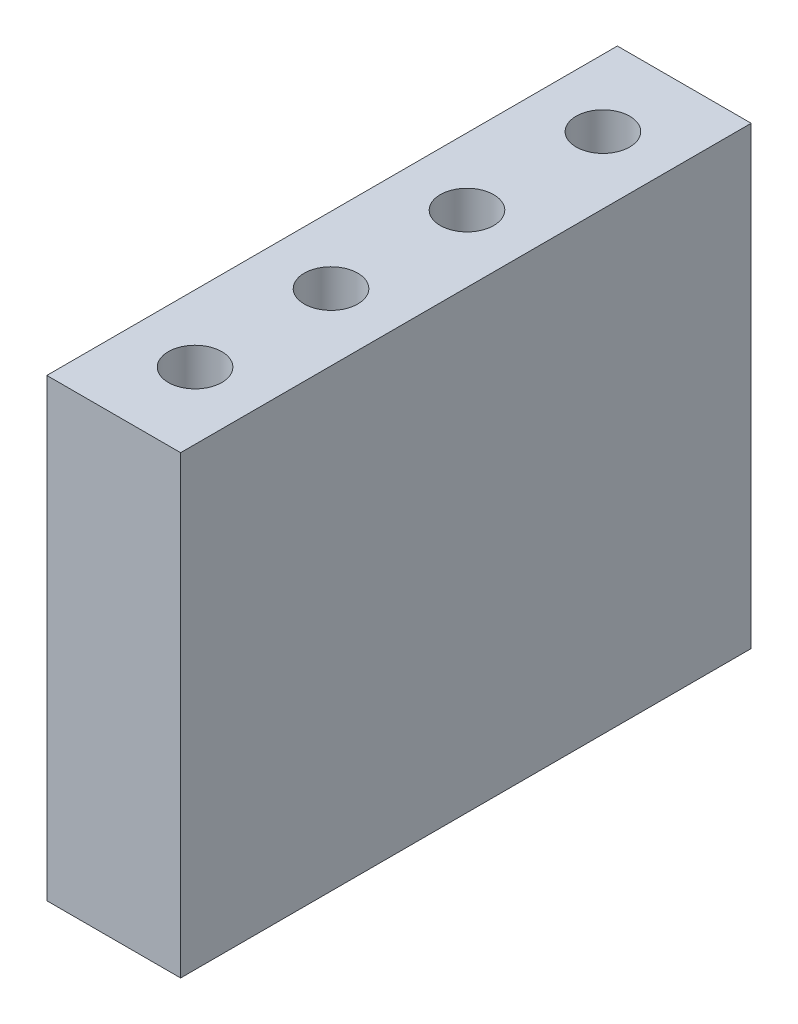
ISO-10303-21;
HEADER;
FILE_DESCRIPTION(('STEP AP214'),'2;1');
FILE_NAME('part.step','',(''),(''),'','','');
FILE_SCHEMA(('AUTOMOTIVE_DESIGN { 1 0 10303 214 1 1 1 1 }'));
ENDSEC;
DATA;
#1=APPLICATION_CONTEXT('core data for automotive mechanical design processes');
#2=APPLICATION_PROTOCOL_DEFINITION('international standard','automotive_design',2000,#1);
#3=PRODUCT_CONTEXT('',#1,'mechanical');
#4=PRODUCT('Part','Part','',(#3));
#5=PRODUCT_RELATED_PRODUCT_CATEGORY('part','',(#4));
#6=PRODUCT_DEFINITION_FORMATION('','',#4);
#7=PRODUCT_DEFINITION_CONTEXT('part definition',#1,'design');
#8=PRODUCT_DEFINITION('design','',#6,#7);
#9=PRODUCT_DEFINITION_SHAPE('','',#8);
#10=(LENGTH_UNIT() NAMED_UNIT(*) SI_UNIT(.MILLI.,.METRE.));
#11=(NAMED_UNIT(*) PLANE_ANGLE_UNIT() SI_UNIT($,.RADIAN.));
#12=(NAMED_UNIT(*) SI_UNIT($,.STERADIAN.) SOLID_ANGLE_UNIT());
#13=UNCERTAINTY_MEASURE_WITH_UNIT(LENGTH_MEASURE(1.E-05),#10,'distance_accuracy_value','');
#14=(GEOMETRIC_REPRESENTATION_CONTEXT(3) GLOBAL_UNCERTAINTY_ASSIGNED_CONTEXT((#13)) GLOBAL_UNIT_ASSIGNED_CONTEXT((#10,
#11,#12)) REPRESENTATION_CONTEXT('',''));
#15=CARTESIAN_POINT('',(0.,0.,0.));
#16=DIRECTION('',(0.,0.,1.));
#17=DIRECTION('',(1.,0.,0.));
#18=AXIS2_PLACEMENT_3D('',#15,#16,#17);
#19=CARTESIAN_POINT('',(0.,8.5,0.));
#20=DIRECTION('',(1.,0.,0.));
#21=DIRECTION('',(0.,0.,-1.));
#22=AXIS2_PLACEMENT_3D('',#19,#20,#21);
#23=PLANE('',#22);
#24=DIRECTION('',(0.,0.,1.));
#25=VECTOR('',#24,1.);
#26=CARTESIAN_POINT('',(0.,0.,0.));
#27=LINE('',#26,#25);
#28=CARTESIAN_POINT('',(0.,0.,-10.660000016));
#29=VERTEX_POINT('',#28);
#30=CARTESIAN_POINT('',(0.,0.,0.));
#31=VERTEX_POINT('',#30);
#32=EDGE_CURVE('E75',#29,#31,#27,.T.);
#33=ORIENTED_EDGE('',*,*,#32,.T.);
#34=DIRECTION('',(0.,-1.,0.));
#35=VECTOR('',#34,1.);
#36=CARTESIAN_POINT('',(0.,8.5,0.));
#37=LINE('',#36,#35);
#38=CARTESIAN_POINT('',(0.,8.5,0.));
#39=VERTEX_POINT('',#38);
#40=EDGE_CURVE('E11',#39,#31,#37,.T.);
#41=ORIENTED_EDGE('',*,*,#40,.F.);
#42=DIRECTION('',(0.,0.,1.));
#43=VECTOR('',#42,1.);
#44=CARTESIAN_POINT('',(0.,8.5,0.));
#45=LINE('',#44,#43);
#46=CARTESIAN_POINT('',(0.,8.5,-10.660000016));
#47=VERTEX_POINT('',#46);
#48=EDGE_CURVE('E98',#47,#39,#45,.T.);
#49=ORIENTED_EDGE('',*,*,#48,.F.);
#50=DIRECTION('',(0.,-1.,0.));
#51=VECTOR('',#50,1.);
#52=CARTESIAN_POINT('',(0.,8.5,-10.660000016));
#53=LINE('',#52,#51);
#54=EDGE_CURVE('E87',#47,#29,#53,.T.);
#55=ORIENTED_EDGE('',*,*,#54,.T.);
#56=EDGE_LOOP('',(#33,#41,#49,#55));
#57=FACE_BOUND('',#56,.T.);
#58=ADVANCED_FACE('F31',(#57),#23,.F.);
#59=CARTESIAN_POINT('',(0.,8.5,0.));
#60=DIRECTION('',(0.,0.,-1.));
#61=DIRECTION('',(-1.,0.,0.));
#62=AXIS2_PLACEMENT_3D('',#59,#60,#61);
#63=PLANE('',#62);
#64=DIRECTION('',(1.,0.,0.));
#65=VECTOR('',#64,1.);
#66=CARTESIAN_POINT('',(0.,0.,0.));
#67=LINE('',#66,#65);
#68=CARTESIAN_POINT('',(2.5,0.,0.));
#69=VERTEX_POINT('',#68);
#70=EDGE_CURVE('E71',#31,#69,#67,.T.);
#71=ORIENTED_EDGE('',*,*,#70,.T.);
#72=DIRECTION('',(0.,-1.,0.));
#73=VECTOR('',#72,1.);
#74=CARTESIAN_POINT('',(2.5,8.5,0.));
#75=LINE('',#74,#73);
#76=CARTESIAN_POINT('',(2.5,8.5,0.));
#77=VERTEX_POINT('',#76);
#78=EDGE_CURVE('E38',#77,#69,#75,.T.);
#79=ORIENTED_EDGE('',*,*,#78,.F.);
#80=DIRECTION('',(1.,0.,0.));
#81=VECTOR('',#80,1.);
#82=CARTESIAN_POINT('',(0.,8.5,0.));
#83=LINE('',#82,#81);
#84=EDGE_CURVE('E83',#39,#77,#83,.T.);
#85=ORIENTED_EDGE('',*,*,#84,.F.);
#86=ORIENTED_EDGE('',*,*,#40,.T.);
#87=EDGE_LOOP('',(#71,#79,#85,#86));
#88=FACE_BOUND('',#87,.T.);
#89=ADVANCED_FACE('F82',(#88),#63,.F.);
#90=CARTESIAN_POINT('',(2.5,8.5,0.));
#91=DIRECTION('',(-1.,0.,0.));
#92=DIRECTION('',(0.,0.,1.));
#93=AXIS2_PLACEMENT_3D('',#90,#91,#92);
#94=PLANE('',#93);
#95=DIRECTION('',(0.,0.,-1.));
#96=VECTOR('',#95,1.);
#97=CARTESIAN_POINT('',(2.5,0.,0.));
#98=LINE('',#97,#96);
#99=CARTESIAN_POINT('',(2.5,0.,-10.660000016));
#100=VERTEX_POINT('',#99);
#101=EDGE_CURVE('E76',#69,#100,#98,.T.);
#102=ORIENTED_EDGE('',*,*,#101,.T.);
#103=DIRECTION('',(0.,-1.,0.));
#104=VECTOR('',#103,1.);
#105=CARTESIAN_POINT('',(2.5,8.5,-10.660000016));
#106=LINE('',#105,#104);
#107=CARTESIAN_POINT('',(2.5,8.5,-10.660000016));
#108=VERTEX_POINT('',#107);
#109=EDGE_CURVE('E104',#108,#100,#106,.T.);
#110=ORIENTED_EDGE('',*,*,#109,.F.);
#111=DIRECTION('',(0.,0.,-1.));
#112=VECTOR('',#111,1.);
#113=CARTESIAN_POINT('',(2.5,8.5,0.));
#114=LINE('',#113,#112);
#115=EDGE_CURVE('E50',#77,#108,#114,.T.);
#116=ORIENTED_EDGE('',*,*,#115,.F.);
#117=ORIENTED_EDGE('',*,*,#78,.T.);
#118=EDGE_LOOP('',(#102,#110,#116,#117));
#119=FACE_BOUND('',#118,.T.);
#120=ADVANCED_FACE('F107',(#119),#94,.F.);
#121=CARTESIAN_POINT('',(0.,8.5,-10.660000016));
#122=DIRECTION('',(0.,0.,1.));
#123=DIRECTION('',(1.,0.,0.));
#124=AXIS2_PLACEMENT_3D('',#121,#122,#123);
#125=PLANE('',#124);
#126=DIRECTION('',(-1.,0.,0.));
#127=VECTOR('',#126,1.);
#128=CARTESIAN_POINT('',(0.,0.,-10.660000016));
#129=LINE('',#128,#127);
#130=EDGE_CURVE('E96',#100,#29,#129,.T.);
#131=ORIENTED_EDGE('',*,*,#130,.T.);
#132=ORIENTED_EDGE('',*,*,#54,.F.);
#133=DIRECTION('',(-1.,0.,0.));
#134=VECTOR('',#133,1.);
#135=CARTESIAN_POINT('',(0.,8.5,-10.660000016));
#136=LINE('',#135,#134);
#137=EDGE_CURVE('E45',#108,#47,#136,.T.);
#138=ORIENTED_EDGE('',*,*,#137,.F.);
#139=ORIENTED_EDGE('',*,*,#109,.T.);
#140=EDGE_LOOP('',(#131,#132,#138,#139));
#141=FACE_BOUND('',#140,.T.);
#142=ADVANCED_FACE('F109',(#141),#125,.F.);
#143=CARTESIAN_POINT('',(0.,8.5,-10.660000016));
#144=DIRECTION('',(0.,-1.,0.));
#145=DIRECTION('',(0.,0.,-1.));
#146=AXIS2_PLACEMENT_3D('',#143,#144,#145);
#147=PLANE('',#146);
#148=CARTESIAN_POINT('',(1.25,8.5,-6.600000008));
#149=DIRECTION('',(0.,1.,0.));
#150=DIRECTION('',(0.,0.,-1.));
#151=AXIS2_PLACEMENT_3D('',#148,#149,#150);
#152=CIRCLE('',#151,0.5);
#153=CARTESIAN_POINT('',(1.25,8.5,-7.100000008));
#154=VERTEX_POINT('',#153);
#155=EDGE_CURVE('E234',#154,#154,#152,.T.);
#156=ORIENTED_EDGE('',*,*,#155,.F.);
#157=EDGE_LOOP('',(#156));
#158=FACE_BOUND('',#157,.T.);
#159=CARTESIAN_POINT('',(1.25,8.5,-9.140000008));
#160=DIRECTION('',(0.,1.,0.));
#161=DIRECTION('',(0.,0.,-1.));
#162=AXIS2_PLACEMENT_3D('',#159,#160,#161);
#163=CIRCLE('',#162,0.5);
#164=CARTESIAN_POINT('',(1.25,8.5,-9.640000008));
#165=VERTEX_POINT('',#164);
#166=EDGE_CURVE('E233',#165,#165,#163,.T.);
#167=ORIENTED_EDGE('',*,*,#166,.F.);
#168=EDGE_LOOP('',(#167));
#169=FACE_BOUND('',#168,.T.);
#170=CARTESIAN_POINT('',(1.25,8.5,-1.520000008));
#171=DIRECTION('',(0.,1.,0.));
#172=DIRECTION('',(0.,0.,1.));
#173=AXIS2_PLACEMENT_3D('',#170,#171,#172);
#174=CIRCLE('',#173,0.499999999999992);
#175=CARTESIAN_POINT('',(1.25,8.5,-1.02000000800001));
#176=VERTEX_POINT('',#175);
#177=EDGE_CURVE('E244',#176,#176,#174,.T.);
#178=ORIENTED_EDGE('',*,*,#177,.F.);
#179=EDGE_LOOP('',(#178));
#180=FACE_BOUND('',#179,.T.);
#181=CARTESIAN_POINT('',(1.25,8.5,-4.060000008));
#182=DIRECTION('',(0.,1.,0.));
#183=DIRECTION('',(0.,0.,1.));
#184=AXIS2_PLACEMENT_3D('',#181,#182,#183);
#185=CIRCLE('',#184,0.5);
#186=CARTESIAN_POINT('',(1.25,8.5,-3.560000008));
#187=VERTEX_POINT('',#186);
#188=EDGE_CURVE('E91',#187,#187,#185,.T.);
#189=ORIENTED_EDGE('',*,*,#188,.F.);
#190=EDGE_LOOP('',(#189));
#191=FACE_BOUND('',#190,.T.);
#192=ORIENTED_EDGE('',*,*,#48,.T.);
#193=ORIENTED_EDGE('',*,*,#84,.T.);
#194=ORIENTED_EDGE('',*,*,#115,.T.);
#195=ORIENTED_EDGE('',*,*,#137,.T.);
#196=EDGE_LOOP('',(#192,#193,#194,#195));
#197=FACE_BOUND('',#196,.T.);
#198=ADVANCED_FACE('F110',(#158,#169,#180,#191,#197),#147,.F.);
#199=CARTESIAN_POINT('',(0.,0.,-10.660000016));
#200=DIRECTION('',(0.,-1.,0.));
#201=DIRECTION('',(0.,0.,-1.));
#202=AXIS2_PLACEMENT_3D('',#199,#200,#201);
#203=PLANE('',#202);
#204=ORIENTED_EDGE('',*,*,#32,.F.);
#205=ORIENTED_EDGE('',*,*,#130,.F.);
#206=ORIENTED_EDGE('',*,*,#101,.F.);
#207=ORIENTED_EDGE('',*,*,#70,.F.);
#208=EDGE_LOOP('',(#204,#205,#206,#207));
#209=FACE_BOUND('',#208,.T.);
#210=ADVANCED_FACE('F72',(#209),#203,.T.);
#211=CARTESIAN_POINT('',(1.25,2.12,-4.060000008));
#212=DIRECTION('',(0.,1.,0.));
#213=DIRECTION('',(0.,0.,1.));
#214=AXIS2_PLACEMENT_3D('',#211,#212,#213);
#215=CYLINDRICAL_SURFACE('',#214,0.5);
#216=CARTESIAN_POINT('',(1.25,2.12,-4.060000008));
#217=DIRECTION('',(0.,1.,0.));
#218=DIRECTION('',(0.,0.,1.));
#219=AXIS2_PLACEMENT_3D('',#216,#217,#218);
#220=CIRCLE('',#219,0.5);
#221=CARTESIAN_POINT('',(1.25,2.12,-3.560000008));
#222=VERTEX_POINT('',#221);
#223=EDGE_CURVE('E88',#222,#222,#220,.T.);
#224=ORIENTED_EDGE('',*,*,#223,.F.);
#225=EDGE_LOOP('',(#224));
#226=FACE_BOUND('',#225,.T.);
#227=ORIENTED_EDGE('',*,*,#188,.T.);
#228=EDGE_LOOP('',(#227));
#229=FACE_BOUND('',#228,.T.);
#230=ADVANCED_FACE('F118',(#226,#229),#215,.F.);
#231=CARTESIAN_POINT('',(1.25,2.12,-4.060000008));
#232=DIRECTION('',(0.,1.,0.));
#233=DIRECTION('',(0.,0.,1.));
#234=AXIS2_PLACEMENT_3D('',#231,#232,#233);
#235=PLANE('',#234);
#236=ORIENTED_EDGE('',*,*,#223,.T.);
#237=EDGE_LOOP('',(#236));
#238=FACE_BOUND('',#237,.T.);
#239=ADVANCED_FACE('F156',(#238),#235,.T.);
#240=CARTESIAN_POINT('',(1.25,2.12,-1.520000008));
#241=DIRECTION('',(0.,1.,0.));
#242=DIRECTION('',(0.,0.,1.));
#243=AXIS2_PLACEMENT_3D('',#240,#241,#242);
#244=CYLINDRICAL_SURFACE('',#243,0.499999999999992);
#245=CARTESIAN_POINT('',(1.25,2.12,-1.520000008));
#246=DIRECTION('',(0.,1.,0.));
#247=DIRECTION('',(0.,0.,1.));
#248=AXIS2_PLACEMENT_3D('',#245,#246,#247);
#249=CIRCLE('',#248,0.499999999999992);
#250=CARTESIAN_POINT('',(1.25,2.12,-1.02000000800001));
#251=VERTEX_POINT('',#250);
#252=EDGE_CURVE('E247',#251,#251,#249,.T.);
#253=ORIENTED_EDGE('',*,*,#252,.F.);
#254=EDGE_LOOP('',(#253));
#255=FACE_BOUND('',#254,.T.);
#256=ORIENTED_EDGE('',*,*,#177,.T.);
#257=EDGE_LOOP('',(#256));
#258=FACE_BOUND('',#257,.T.);
#259=ADVANCED_FACE('F166',(#255,#258),#244,.F.);
#260=CARTESIAN_POINT('',(1.25,2.12,-1.520000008));
#261=DIRECTION('',(0.,1.,0.));
#262=DIRECTION('',(0.,0.,1.));
#263=AXIS2_PLACEMENT_3D('',#260,#261,#262);
#264=PLANE('',#263);
#265=ORIENTED_EDGE('',*,*,#252,.T.);
#266=EDGE_LOOP('',(#265));
#267=FACE_BOUND('',#266,.T.);
#268=ADVANCED_FACE('F176',(#267),#264,.T.);
#269=CARTESIAN_POINT('',(1.25,2.12,-9.140000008));
#270=DIRECTION('',(0.,1.,0.));
#271=DIRECTION('',(0.,0.,1.));
#272=AXIS2_PLACEMENT_3D('',#269,#270,#271);
#273=CYLINDRICAL_SURFACE('',#272,0.5);
#274=CARTESIAN_POINT('',(1.25,2.12,-9.140000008));
#275=DIRECTION('',(0.,1.,0.));
#276=DIRECTION('',(0.,0.,-1.));
#277=AXIS2_PLACEMENT_3D('',#274,#275,#276);
#278=CIRCLE('',#277,0.5);
#279=CARTESIAN_POINT('',(1.25,2.12,-9.640000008));
#280=VERTEX_POINT('',#279);
#281=EDGE_CURVE('E237',#280,#280,#278,.T.);
#282=ORIENTED_EDGE('',*,*,#281,.F.);
#283=EDGE_LOOP('',(#282));
#284=FACE_BOUND('',#283,.T.);
#285=ORIENTED_EDGE('',*,*,#166,.T.);
#286=EDGE_LOOP('',(#285));
#287=FACE_BOUND('',#286,.T.);
#288=ADVANCED_FACE('F186',(#284,#287),#273,.F.);
#289=CARTESIAN_POINT('',(1.25,2.12,-9.140000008));
#290=DIRECTION('',(0.,-1.,0.));
#291=DIRECTION('',(0.,0.,-1.));
#292=AXIS2_PLACEMENT_3D('',#289,#290,#291);
#293=PLANE('',#292);
#294=ORIENTED_EDGE('',*,*,#281,.T.);
#295=EDGE_LOOP('',(#294));
#296=FACE_BOUND('',#295,.T.);
#297=ADVANCED_FACE('F196',(#296),#293,.F.);
#298=CARTESIAN_POINT('',(1.25,2.12,-6.600000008));
#299=DIRECTION('',(0.,1.,0.));
#300=DIRECTION('',(0.,0.,1.));
#301=AXIS2_PLACEMENT_3D('',#298,#299,#300);
#302=CYLINDRICAL_SURFACE('',#301,0.5);
#303=CARTESIAN_POINT('',(1.25,2.12,-6.600000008));
#304=DIRECTION('',(0.,1.,0.));
#305=DIRECTION('',(0.,0.,-1.));
#306=AXIS2_PLACEMENT_3D('',#303,#304,#305);
#307=CIRCLE('',#306,0.5);
#308=CARTESIAN_POINT('',(1.25,2.12,-7.100000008));
#309=VERTEX_POINT('',#308);
#310=EDGE_CURVE('E232',#309,#309,#307,.T.);
#311=ORIENTED_EDGE('',*,*,#310,.F.);
#312=EDGE_LOOP('',(#311));
#313=FACE_BOUND('',#312,.T.);
#314=ORIENTED_EDGE('',*,*,#155,.T.);
#315=EDGE_LOOP('',(#314));
#316=FACE_BOUND('',#315,.T.);
#317=ADVANCED_FACE('F206',(#313,#316),#302,.F.);
#318=CARTESIAN_POINT('',(1.25,2.12,-6.600000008));
#319=DIRECTION('',(0.,-1.,0.));
#320=DIRECTION('',(0.,0.,-1.));
#321=AXIS2_PLACEMENT_3D('',#318,#319,#320);
#322=PLANE('',#321);
#323=ORIENTED_EDGE('',*,*,#310,.T.);
#324=EDGE_LOOP('',(#323));
#325=FACE_BOUND('',#324,.T.);
#326=ADVANCED_FACE('F216',(#325),#322,.F.);
#327=CLOSED_SHELL('',(#58,#89,#120,#142,#198,#210,#230,#239,#259,#268,#288,#297,#317,#326));
#328=MANIFOLD_SOLID_BREP('B2',#327);
#329=ADVANCED_BREP_SHAPE_REPRESENTATION('',(#18,#328),#14);
#330=SHAPE_DEFINITION_REPRESENTATION(#9,#329);
ENDSEC;
END-ISO-10303-21;
